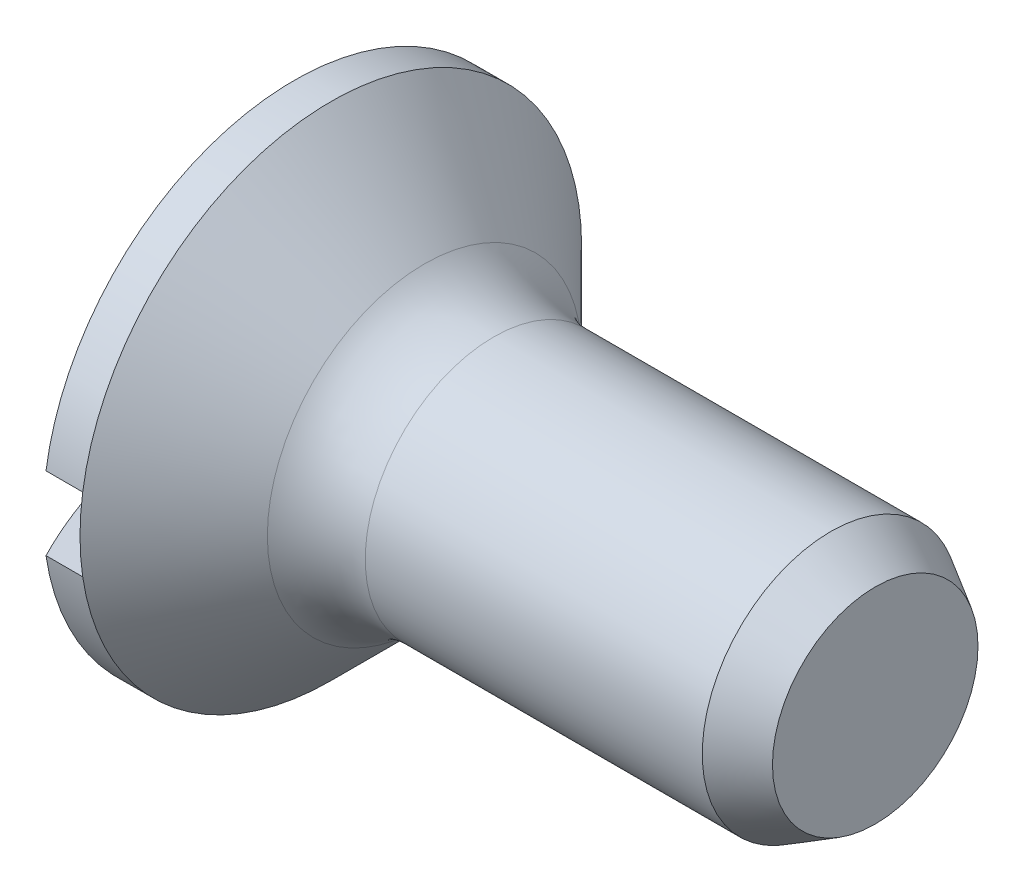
ISO-10303-21;
HEADER;
FILE_DESCRIPTION(('STEP AP214'),'2;1');
FILE_NAME('part.step','',(''),(''),'','','');
FILE_SCHEMA(('AUTOMOTIVE_DESIGN { 1 0 10303 214 1 1 1 1 }'));
ENDSEC;
DATA;
#1=APPLICATION_CONTEXT('core data for automotive mechanical design processes');
#2=APPLICATION_PROTOCOL_DEFINITION('international standard','automotive_design',2000,#1);
#3=PRODUCT_CONTEXT('',#1,'mechanical');
#4=PRODUCT('Part','Part','',(#3));
#5=PRODUCT_RELATED_PRODUCT_CATEGORY('part','',(#4));
#6=PRODUCT_DEFINITION_FORMATION('','',#4);
#7=PRODUCT_DEFINITION_CONTEXT('part definition',#1,'design');
#8=PRODUCT_DEFINITION('design','',#6,#7);
#9=PRODUCT_DEFINITION_SHAPE('','',#8);
#10=(LENGTH_UNIT() NAMED_UNIT(*) SI_UNIT(.MILLI.,.METRE.));
#11=(NAMED_UNIT(*) PLANE_ANGLE_UNIT() SI_UNIT($,.RADIAN.));
#12=(NAMED_UNIT(*) SI_UNIT($,.STERADIAN.) SOLID_ANGLE_UNIT());
#13=UNCERTAINTY_MEASURE_WITH_UNIT(LENGTH_MEASURE(1.E-05),#10,'distance_accuracy_value','');
#14=(GEOMETRIC_REPRESENTATION_CONTEXT(3) GLOBAL_UNCERTAINTY_ASSIGNED_CONTEXT((#13)) GLOBAL_UNIT_ASSIGNED_CONTEXT((#10,
#11,#12)) REPRESENTATION_CONTEXT('',''));
#15=CARTESIAN_POINT('',(0.,0.,0.));
#16=DIRECTION('',(0.,0.,1.));
#17=DIRECTION('',(1.,0.,0.));
#18=AXIS2_PLACEMENT_3D('',#15,#16,#17);
#19=CARTESIAN_POINT('',(7.90499999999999,0.,0.));
#20=DIRECTION('',(1.,0.,0.));
#21=DIRECTION('',(0.,1.,0.));
#22=AXIS2_PLACEMENT_3D('',#19,#20,#21);
#23=SPHERICAL_SURFACE('',#22,8.90499999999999);
#24=CARTESIAN_POINT('',(7.90499999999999,0.600000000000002,0.));
#25=DIRECTION('',(0.,1.,0.));
#26=DIRECTION('',(-1.,0.,0.));
#27=AXIS2_PLACEMENT_3D('',#24,#25,#26);
#28=CIRCLE('',#27,8.88476364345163);
#29=CARTESIAN_POINT('',(0.,0.6,4.05585995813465));
#30=VERTEX_POINT('',#29);
#31=CARTESIAN_POINT('',(0.,0.600000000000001,-4.05585995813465));
#32=VERTEX_POINT('',#31);
#33=EDGE_CURVE('E157',#30,#32,#28,.F.);
#34=ORIENTED_EDGE('',*,*,#33,.F.);
#35=CARTESIAN_POINT('',(0.,0.,0.));
#36=DIRECTION('',(1.,0.,0.));
#37=DIRECTION('',(0.,1.,0.));
#38=AXIS2_PLACEMENT_3D('',#35,#36,#37);
#39=CIRCLE('',#38,4.1);
#40=EDGE_CURVE('E115',#32,#30,#39,.T.);
#41=ORIENTED_EDGE('',*,*,#40,.F.);
#42=EDGE_LOOP('',(#34,#41));
#43=FACE_BOUND('',#42,.T.);
#44=ADVANCED_FACE('F39',(#43),#23,.T.);
#45=CARTESIAN_POINT('',(6.62068469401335,0.,0.));
#46=DIRECTION('',(1.,0.,0.));
#47=DIRECTION('',(0.,1.,0.));
#48=AXIS2_PLACEMENT_3D('',#45,#46,#47);
#49=CYLINDRICAL_SURFACE('',#48,4.1);
#50=DIRECTION('',(1.,0.,0.));
#51=VECTOR('',#50,1.);
#52=CARTESIAN_POINT('',(6.62068469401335,0.600000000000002,4.05585995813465));
#53=LINE('',#52,#51);
#54=CARTESIAN_POINT('',(0.600000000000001,0.6,4.05585995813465));
#55=VERTEX_POINT('',#54);
#56=EDGE_CURVE('E64',#55,#30,#53,.F.);
#57=ORIENTED_EDGE('',*,*,#56,.F.);
#58=CARTESIAN_POINT('',(0.599999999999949,0.,0.));
#59=DIRECTION('',(1.,0.,0.));
#60=DIRECTION('',(0.,1.,0.));
#61=AXIS2_PLACEMENT_3D('',#58,#59,#60);
#62=CIRCLE('',#61,4.1);
#63=CARTESIAN_POINT('',(0.600000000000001,0.6,-4.05585995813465));
#64=VERTEX_POINT('',#63);
#65=EDGE_CURVE('E91',#64,#55,#62,.T.);
#66=ORIENTED_EDGE('',*,*,#65,.F.);
#67=DIRECTION('',(1.,0.,0.));
#68=VECTOR('',#67,1.);
#69=CARTESIAN_POINT('',(6.62068469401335,0.600000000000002,-4.05585995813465));
#70=LINE('',#69,#68);
#71=EDGE_CURVE('E106',#32,#64,#70,.T.);
#72=ORIENTED_EDGE('',*,*,#71,.F.);
#73=ORIENTED_EDGE('',*,*,#40,.T.);
#74=EDGE_LOOP('',(#57,#66,#72,#73));
#75=FACE_BOUND('',#74,.T.);
#76=ADVANCED_FACE('F139',(#75),#49,.T.);
#77=CARTESIAN_POINT('',(7.90499999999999,-0.6,0.));
#78=DIRECTION('',(0.,-1.,0.));
#79=DIRECTION('',(0.,0.,-1.));
#80=AXIS2_PLACEMENT_3D('',#77,#78,#79);
#81=CIRCLE('',#80,8.88476364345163);
#82=CARTESIAN_POINT('',(0.,-0.6,-4.05585995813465));
#83=VERTEX_POINT('',#82);
#84=CARTESIAN_POINT('',(0.,-0.600000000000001,4.05585995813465));
#85=VERTEX_POINT('',#84);
#86=EDGE_CURVE('E53',#83,#85,#81,.F.);
#87=ORIENTED_EDGE('',*,*,#86,.F.);
#88=EDGE_CURVE('E102',#85,#83,#39,.T.);
#89=ORIENTED_EDGE('',*,*,#88,.F.);
#90=EDGE_LOOP('',(#87,#89));
#91=FACE_BOUND('',#90,.T.);
#92=ADVANCED_FACE('F142',(#91),#23,.T.);
#93=CARTESIAN_POINT('',(9.5,2.1,0.));
#94=DIRECTION('',(1.,0.,0.));
#95=DIRECTION('',(0.,1.,0.));
#96=AXIS2_PLACEMENT_3D('',#93,#94,#95);
#97=PLANE('',#96);
#98=CARTESIAN_POINT('',(9.5,0.,0.));
#99=DIRECTION('',(1.,0.,0.));
#100=DIRECTION('',(0.,1.,0.));
#101=AXIS2_PLACEMENT_3D('',#98,#99,#100);
#102=CIRCLE('',#101,1.68);
#103=CARTESIAN_POINT('',(9.5,1.68,0.));
#104=VERTEX_POINT('',#103);
#105=EDGE_CURVE('E120',#104,#104,#102,.T.);
#106=ORIENTED_EDGE('',*,*,#105,.T.);
#107=EDGE_LOOP('',(#106));
#108=FACE_BOUND('',#107,.T.);
#109=ADVANCED_FACE('F146',(#108),#97,.T.);
#110=CARTESIAN_POINT('',(6.62068469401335,0.,0.));
#111=DIRECTION('',(1.,0.,0.));
#112=DIRECTION('',(0.,1.,0.));
#113=AXIS2_PLACEMENT_3D('',#110,#111,#112);
#114=CYLINDRICAL_SURFACE('',#113,2.1);
#115=CARTESIAN_POINT('',(3.26274169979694,0.,0.));
#116=DIRECTION('',(1.,0.,0.));
#117=DIRECTION('',(0.,1.,0.));
#118=AXIS2_PLACEMENT_3D('',#115,#116,#117);
#119=CIRCLE('',#118,2.1);
#120=CARTESIAN_POINT('',(3.26274169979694,2.1,0.));
#121=VERTEX_POINT('',#120);
#122=EDGE_CURVE('E50',#121,#121,#119,.T.);
#123=ORIENTED_EDGE('',*,*,#122,.T.);
#124=EDGE_LOOP('',(#123));
#125=FACE_BOUND('',#124,.T.);
#126=CARTESIAN_POINT('',(8.77253866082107,0.,0.));
#127=DIRECTION('',(1.,0.,0.));
#128=DIRECTION('',(0.,1.,0.));
#129=AXIS2_PLACEMENT_3D('',#126,#127,#128);
#130=CIRCLE('',#129,2.1);
#131=CARTESIAN_POINT('',(8.77253866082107,2.1,0.));
#132=VERTEX_POINT('',#131);
#133=EDGE_CURVE('E119',#132,#132,#130,.F.);
#134=ORIENTED_EDGE('',*,*,#133,.T.);
#135=EDGE_LOOP('',(#134));
#136=FACE_BOUND('',#135,.T.);
#137=ADVANCED_FACE('F123',(#125,#136),#114,.T.);
#138=CARTESIAN_POINT('',(2.6,0.,0.));
#139=DIRECTION('',(-1.,0.,0.));
#140=DIRECTION('',(0.,-1.,0.));
#141=AXIS2_PLACEMENT_3D('',#138,#139,#140);
#142=CONICAL_SURFACE('',#141,2.1,0.785398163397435);
#143=CARTESIAN_POINT('',(2.13137084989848,0.,0.));
#144=DIRECTION('',(-1.,0.,0.));
#145=DIRECTION('',(0.,-1.,0.));
#146=AXIS2_PLACEMENT_3D('',#143,#144,#145);
#147=CIRCLE('',#146,2.56862915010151);
#148=CARTESIAN_POINT('',(2.13137084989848,-2.56862915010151,0.));
#149=VERTEX_POINT('',#148);
#150=EDGE_CURVE('E11',#149,#149,#147,.T.);
#151=ORIENTED_EDGE('',*,*,#150,.T.);
#152=EDGE_LOOP('',(#151));
#153=FACE_BOUND('',#152,.T.);
#154=CARTESIAN_POINT('',(0.600000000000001,-0.6,4.05585995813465));
#155=VERTEX_POINT('',#154);
#156=EDGE_CURVE('E107',#55,#155,#62,.T.);
#157=ORIENTED_EDGE('',*,*,#156,.T.);
#158=CARTESIAN_POINT('',(0.600000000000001,-0.6,-4.05585995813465));
#159=VERTEX_POINT('',#158);
#160=EDGE_CURVE('E94',#155,#159,#62,.T.);
#161=ORIENTED_EDGE('',*,*,#160,.T.);
#162=EDGE_CURVE('E84',#159,#64,#62,.T.);
#163=ORIENTED_EDGE('',*,*,#162,.T.);
#164=ORIENTED_EDGE('',*,*,#65,.T.);
#165=EDGE_LOOP('',(#157,#161,#163,#164));
#166=FACE_BOUND('',#165,.T.);
#167=ADVANCED_FACE('F108',(#153,#166),#142,.T.);
#168=DIRECTION('',(1.,0.,0.));
#169=VECTOR('',#168,1.);
#170=CARTESIAN_POINT('',(6.62068469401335,-0.6,-4.05585995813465));
#171=LINE('',#170,#169);
#172=EDGE_CURVE('E96',#159,#83,#171,.F.);
#173=ORIENTED_EDGE('',*,*,#172,.F.);
#174=ORIENTED_EDGE('',*,*,#160,.F.);
#175=DIRECTION('',(1.,0.,0.));
#176=VECTOR('',#175,1.);
#177=CARTESIAN_POINT('',(6.62068469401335,-0.6,4.05585995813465));
#178=LINE('',#177,#176);
#179=EDGE_CURVE('E100',#85,#155,#178,.T.);
#180=ORIENTED_EDGE('',*,*,#179,.F.);
#181=ORIENTED_EDGE('',*,*,#88,.T.);
#182=EDGE_LOOP('',(#173,#174,#180,#181));
#183=FACE_BOUND('',#182,.T.);
#184=ADVANCED_FACE('F101',(#183),#49,.T.);
#185=CARTESIAN_POINT('',(-0.999999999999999,0.6,-4.1));
#186=DIRECTION('',(0.,1.,0.));
#187=DIRECTION('',(-1.,0.,0.));
#188=AXIS2_PLACEMENT_3D('',#185,#186,#187);
#189=PLANE('',#188);
#190=ORIENTED_EDGE('',*,*,#56,.T.);
#191=ORIENTED_EDGE('',*,*,#33,.T.);
#192=ORIENTED_EDGE('',*,*,#71,.T.);
#193=DIRECTION('',(0.,0.,1.));
#194=VECTOR('',#193,1.);
#195=CARTESIAN_POINT('',(0.600000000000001,0.6,-4.1));
#196=LINE('',#195,#194);
#197=EDGE_CURVE('E89',#64,#55,#196,.T.);
#198=ORIENTED_EDGE('',*,*,#197,.T.);
#199=EDGE_LOOP('',(#190,#191,#192,#198));
#200=FACE_BOUND('',#199,.T.);
#201=ADVANCED_FACE('F156',(#200),#189,.F.);
#202=CARTESIAN_POINT('',(0.600000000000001,0.6,-4.1));
#203=DIRECTION('',(1.,0.,0.));
#204=DIRECTION('',(0.,1.,0.));
#205=AXIS2_PLACEMENT_3D('',#202,#203,#204);
#206=PLANE('',#205);
#207=ORIENTED_EDGE('',*,*,#197,.F.);
#208=ORIENTED_EDGE('',*,*,#162,.F.);
#209=DIRECTION('',(0.,0.,1.));
#210=VECTOR('',#209,1.);
#211=CARTESIAN_POINT('',(0.600000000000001,-0.6,-4.1));
#212=LINE('',#211,#210);
#213=EDGE_CURVE('E83',#159,#155,#212,.T.);
#214=ORIENTED_EDGE('',*,*,#213,.T.);
#215=ORIENTED_EDGE('',*,*,#156,.F.);
#216=EDGE_LOOP('',(#207,#208,#214,#215));
#217=FACE_BOUND('',#216,.T.);
#218=ADVANCED_FACE('F81',(#217),#206,.F.);
#219=CARTESIAN_POINT('',(-0.999999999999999,-0.6,-4.1));
#220=DIRECTION('',(0.,-1.,0.));
#221=DIRECTION('',(0.,0.,-1.));
#222=AXIS2_PLACEMENT_3D('',#219,#220,#221);
#223=PLANE('',#222);
#224=ORIENTED_EDGE('',*,*,#172,.T.);
#225=ORIENTED_EDGE('',*,*,#86,.T.);
#226=ORIENTED_EDGE('',*,*,#179,.T.);
#227=ORIENTED_EDGE('',*,*,#213,.F.);
#228=EDGE_LOOP('',(#224,#225,#226,#227));
#229=FACE_BOUND('',#228,.T.);
#230=ADVANCED_FACE('F97',(#229),#223,.F.);
#231=CARTESIAN_POINT('',(9.5,0.,0.));
#232=DIRECTION('',(-1.,0.,0.));
#233=DIRECTION('',(0.,-1.,0.));
#234=AXIS2_PLACEMENT_3D('',#231,#232,#233);
#235=CONICAL_SURFACE('',#234,1.68,0.523598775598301);
#236=ORIENTED_EDGE('',*,*,#133,.F.);
#237=EDGE_LOOP('',(#236));
#238=FACE_BOUND('',#237,.T.);
#239=ORIENTED_EDGE('',*,*,#105,.F.);
#240=EDGE_LOOP('',(#239));
#241=FACE_BOUND('',#240,.T.);
#242=ADVANCED_FACE('F126',(#238,#241),#235,.T.);
#243=CARTESIAN_POINT('',(3.26274169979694,0.,0.));
#244=DIRECTION('',(1.,0.,0.));
#245=DIRECTION('',(0.,1.,0.));
#246=AXIS2_PLACEMENT_3D('',#243,#244,#245);
#247=TOROIDAL_SURFACE('',#246,3.7,1.6);
#248=ORIENTED_EDGE('',*,*,#150,.F.);
#249=EDGE_LOOP('',(#248));
#250=FACE_BOUND('',#249,.T.);
#251=ORIENTED_EDGE('',*,*,#122,.F.);
#252=EDGE_LOOP('',(#251));
#253=FACE_BOUND('',#252,.T.);
#254=ADVANCED_FACE('F41',(#250,#253),#247,.F.);
#255=CLOSED_SHELL('',(#44,#76,#92,#109,#137,#167,#184,#201,#218,#230,#242,#254));
#256=MANIFOLD_SOLID_BREP('B2',#255);
#257=ADVANCED_BREP_SHAPE_REPRESENTATION('',(#18,#256),#14);
#258=SHAPE_DEFINITION_REPRESENTATION(#9,#257);
ENDSEC;
END-ISO-10303-21;
